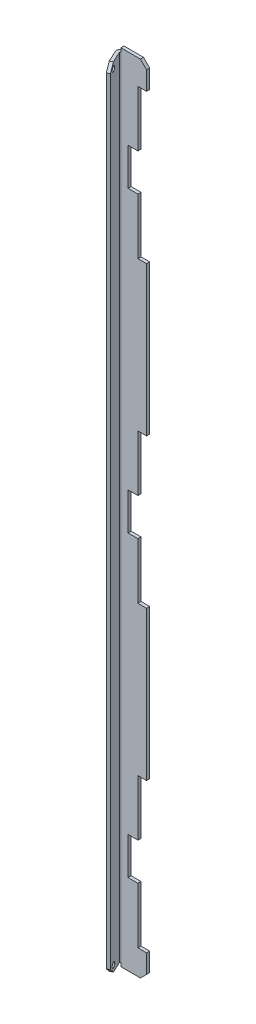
ISO-10303-21;
HEADER;
FILE_DESCRIPTION(('STEP AP214'),'2;1');
FILE_NAME('part.step','',(''),(''),'','','');
FILE_SCHEMA(('AUTOMOTIVE_DESIGN { 1 0 10303 214 1 1 1 1 }'));
ENDSEC;
DATA;
#1=APPLICATION_CONTEXT('core data for automotive mechanical design processes');
#2=APPLICATION_PROTOCOL_DEFINITION('international standard','automotive_design',2000,#1);
#3=PRODUCT_CONTEXT('',#1,'mechanical');
#4=PRODUCT('Part','Part','',(#3));
#5=PRODUCT_RELATED_PRODUCT_CATEGORY('part','',(#4));
#6=PRODUCT_DEFINITION_FORMATION('','',#4);
#7=PRODUCT_DEFINITION_CONTEXT('part definition',#1,'design');
#8=PRODUCT_DEFINITION('design','',#6,#7);
#9=PRODUCT_DEFINITION_SHAPE('','',#8);
#10=(LENGTH_UNIT() NAMED_UNIT(*) SI_UNIT(.MILLI.,.METRE.));
#11=(NAMED_UNIT(*) PLANE_ANGLE_UNIT() SI_UNIT($,.RADIAN.));
#12=(NAMED_UNIT(*) SI_UNIT($,.STERADIAN.) SOLID_ANGLE_UNIT());
#13=UNCERTAINTY_MEASURE_WITH_UNIT(LENGTH_MEASURE(1.E-05),#10,'distance_accuracy_value','');
#14=(GEOMETRIC_REPRESENTATION_CONTEXT(3) GLOBAL_UNCERTAINTY_ASSIGNED_CONTEXT((#13)) GLOBAL_UNIT_ASSIGNED_CONTEXT((#10,
#11,#12)) REPRESENTATION_CONTEXT('',''));
#15=CARTESIAN_POINT('',(0.,0.,0.));
#16=DIRECTION('',(0.,0.,1.));
#17=DIRECTION('',(1.,0.,0.));
#18=AXIS2_PLACEMENT_3D('',#15,#16,#17);
#19=CARTESIAN_POINT('',(-11.6273246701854,-320.,1.05654565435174));
#20=DIRECTION('',(0.906307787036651,0.,-0.422618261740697));
#21=DIRECTION('',(-0.422618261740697,0.,-0.906307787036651));
#22=AXIS2_PLACEMENT_3D('',#19,#20,#21);
#23=PLANE('',#22);
#24=DIRECTION('',(0.,1.,0.));
#25=VECTOR('',#24,1.);
#26=CARTESIAN_POINT('',(-4.95596320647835,-320.,15.3633264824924));
#27=LINE('',#26,#25);
#28=CARTESIAN_POINT('',(-4.95596320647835,-312.,15.3633264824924));
#29=VERTEX_POINT('',#28);
#30=CARTESIAN_POINT('',(-4.95596320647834,312.,15.3633264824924));
#31=VERTEX_POINT('',#30);
#32=EDGE_CURVE('E608',#29,#31,#27,.T.);
#33=ORIENTED_EDGE('',*,*,#32,.T.);
#34=DIRECTION('',(-0.298836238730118,0.707106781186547,-0.64085638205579));
#35=VECTOR('',#34,1.);
#36=CARTESIAN_POINT('',(-7.06905451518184,317.,10.8317875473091));
#37=LINE('',#36,#35);
#38=CARTESIAN_POINT('',(-7.06905451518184,317.,10.8317875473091));
#39=VERTEX_POINT('',#38);
#40=EDGE_CURVE('E13',#31,#39,#37,.T.);
#41=ORIENTED_EDGE('',*,*,#40,.T.);
#42=DIRECTION('',(0.422618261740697,0.,0.906307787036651));
#43=VECTOR('',#42,1.);
#44=CARTESIAN_POINT('',(-11.295635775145,317.,1.7678547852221));
#45=LINE('',#44,#43);
#46=CARTESIAN_POINT('',(-11.295635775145,317.,1.7678547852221));
#47=VERTEX_POINT('',#46);
#48=EDGE_CURVE('E424',#47,#39,#45,.T.);
#49=ORIENTED_EDGE('',*,*,#48,.F.);
#50=DIRECTION('',(0.,-1.,0.));
#51=VECTOR('',#50,1.);
#52=CARTESIAN_POINT('',(-11.295635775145,320.,1.76785478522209));
#53=LINE('',#52,#51);
#54=CARTESIAN_POINT('',(-11.295635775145,-317.,1.7678547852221));
#55=VERTEX_POINT('',#54);
#56=EDGE_CURVE('E611',#55,#47,#53,.F.);
#57=ORIENTED_EDGE('',*,*,#56,.F.);
#58=DIRECTION('',(0.422618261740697,0.,0.906307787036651));
#59=VECTOR('',#58,1.);
#60=CARTESIAN_POINT('',(-11.295635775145,-317.,1.7678547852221));
#61=LINE('',#60,#59);
#62=CARTESIAN_POINT('',(-7.06905451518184,-317.,10.8317875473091));
#63=VERTEX_POINT('',#62);
#64=EDGE_CURVE('E329',#55,#63,#61,.T.);
#65=ORIENTED_EDGE('',*,*,#64,.T.);
#66=DIRECTION('',(0.298836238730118,0.707106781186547,0.64085638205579));
#67=VECTOR('',#66,1.);
#68=CARTESIAN_POINT('',(-4.95596320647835,-312.,15.3633264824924));
#69=LINE('',#68,#67);
#70=EDGE_CURVE('E401',#63,#29,#69,.T.);
#71=ORIENTED_EDGE('',*,*,#70,.T.);
#72=EDGE_LOOP('',(#33,#41,#49,#57,#65,#71));
#73=FACE_BOUND('',#72,.T.);
#74=CARTESIAN_POINT('',(-7.06905451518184,312.,10.8317875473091));
#75=DIRECTION('',(-0.906307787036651,0.,0.422618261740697));
#76=DIRECTION('',(0.422618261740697,0.,0.906307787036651));
#77=AXIS2_PLACEMENT_3D('',#74,#75,#76);
#78=CIRCLE('',#77,2.);
#79=CARTESIAN_POINT('',(-6.22381799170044,312.,12.6444031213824));
#80=VERTEX_POINT('',#79);
#81=EDGE_CURVE('E408',#80,#80,#78,.T.);
#82=ORIENTED_EDGE('',*,*,#81,.F.);
#83=EDGE_LOOP('',(#82));
#84=FACE_BOUND('',#83,.T.);
#85=CARTESIAN_POINT('',(-7.06905451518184,-312.,10.8317875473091));
#86=DIRECTION('',(0.906307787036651,0.,-0.422618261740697));
#87=DIRECTION('',(0.422618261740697,0.,0.906307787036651));
#88=AXIS2_PLACEMENT_3D('',#85,#86,#87);
#89=CIRCLE('',#88,2.);
#90=CARTESIAN_POINT('',(-6.22381799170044,-312.,12.6444031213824));
#91=VERTEX_POINT('',#90);
#92=EDGE_CURVE('E416',#91,#91,#89,.T.);
#93=ORIENTED_EDGE('',*,*,#92,.T.);
#94=EDGE_LOOP('',(#93));
#95=FACE_BOUND('',#94,.T.);
#96=ADVANCED_FACE('F64',(#73,#84,#95),#23,.F.);
#97=CARTESIAN_POINT('',(-9.36155520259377,-320.,0.));
#98=DIRECTION('',(0.906307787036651,0.,-0.422618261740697));
#99=DIRECTION('',(-0.422618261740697,0.,-0.906307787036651));
#100=AXIS2_PLACEMENT_3D('',#97,#98,#99);
#101=PLANE('',#100);
#102=DIRECTION('',(-0.422618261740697,0.,-0.906307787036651));
#103=VECTOR('',#102,1.);
#104=CARTESIAN_POINT('',(-2.69019373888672,317.,14.3067808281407));
#105=LINE('',#104,#103);
#106=CARTESIAN_POINT('',(-4.80328504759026,317.,9.77524189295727));
#107=VERTEX_POINT('',#106);
#108=CARTESIAN_POINT('',(-9.02986630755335,317.,0.711309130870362));
#109=VERTEX_POINT('',#108);
#110=EDGE_CURVE('E427',#107,#109,#105,.T.);
#111=ORIENTED_EDGE('',*,*,#110,.F.);
#112=DIRECTION('',(0.298836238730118,-0.707106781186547,0.64085638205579));
#113=VECTOR('',#112,1.);
#114=CARTESIAN_POINT('',(127.52149623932,3.89289302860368,293.546651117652));
#115=LINE('',#114,#113);
#116=CARTESIAN_POINT('',(-2.69019373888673,312.,14.3067808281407));
#117=VERTEX_POINT('',#116);
#118=EDGE_CURVE('E88',#107,#117,#115,.T.);
#119=ORIENTED_EDGE('',*,*,#118,.T.);
#120=DIRECTION('',(0.,-1.,0.));
#121=VECTOR('',#120,1.);
#122=CARTESIAN_POINT('',(-2.69019373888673,320.,14.3067808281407));
#123=LINE('',#122,#121);
#124=CARTESIAN_POINT('',(-2.69019373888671,-312.,14.3067808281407));
#125=VERTEX_POINT('',#124);
#126=EDGE_CURVE('E610',#125,#117,#123,.F.);
#127=ORIENTED_EDGE('',*,*,#126,.F.);
#128=DIRECTION('',(-0.298836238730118,-0.707106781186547,-0.64085638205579));
#129=VECTOR('',#128,1.);
#130=CARTESIAN_POINT('',(-7.71634751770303,-323.892893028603,3.52815926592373));
#131=LINE('',#130,#129);
#132=CARTESIAN_POINT('',(-4.80328504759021,-317.,9.77524189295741));
#133=VERTEX_POINT('',#132);
#134=EDGE_CURVE('E397',#125,#133,#131,.T.);
#135=ORIENTED_EDGE('',*,*,#134,.T.);
#136=DIRECTION('',(-0.422618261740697,0.,-0.906307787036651));
#137=VECTOR('',#136,1.);
#138=CARTESIAN_POINT('',(-2.69019373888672,-317.,14.3067808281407));
#139=LINE('',#138,#137);
#140=CARTESIAN_POINT('',(-9.02986630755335,-317.,0.711309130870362));
#141=VERTEX_POINT('',#140);
#142=EDGE_CURVE('E420',#133,#141,#139,.T.);
#143=ORIENTED_EDGE('',*,*,#142,.T.);
#144=DIRECTION('',(0.,-1.,0.));
#145=VECTOR('',#144,1.);
#146=CARTESIAN_POINT('',(-9.02986630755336,320.,0.711309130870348));
#147=LINE('',#146,#145);
#148=EDGE_CURVE('E353',#109,#141,#147,.T.);
#149=ORIENTED_EDGE('',*,*,#148,.F.);
#150=EDGE_LOOP('',(#111,#119,#127,#135,#143,#149));
#151=FACE_BOUND('',#150,.T.);
#152=CARTESIAN_POINT('',(-4.80328504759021,312.,9.7752418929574));
#153=DIRECTION('',(0.906307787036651,0.,-0.422618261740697));
#154=DIRECTION('',(-0.422618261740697,0.,-0.906307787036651));
#155=AXIS2_PLACEMENT_3D('',#152,#153,#154);
#156=CIRCLE('',#155,2.);
#157=CARTESIAN_POINT('',(-5.6485215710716,312.,7.9626263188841));
#158=VERTEX_POINT('',#157);
#159=EDGE_CURVE('E332',#158,#158,#156,.T.);
#160=ORIENTED_EDGE('',*,*,#159,.F.);
#161=EDGE_LOOP('',(#160));
#162=FACE_BOUND('',#161,.T.);
#163=CARTESIAN_POINT('',(-4.80328504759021,-312.,9.7752418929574));
#164=DIRECTION('',(0.906307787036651,0.,-0.422618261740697));
#165=DIRECTION('',(-0.422618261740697,0.,-0.906307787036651));
#166=AXIS2_PLACEMENT_3D('',#163,#164,#165);
#167=CIRCLE('',#166,2.);
#168=CARTESIAN_POINT('',(-5.6485215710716,-312.,7.9626263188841));
#169=VERTEX_POINT('',#168);
#170=EDGE_CURVE('E68',#169,#169,#167,.F.);
#171=ORIENTED_EDGE('',*,*,#170,.T.);
#172=EDGE_LOOP('',(#171));
#173=FACE_BOUND('',#172,.T.);
#174=ADVANCED_FACE('F618',(#151,#162,#173),#101,.T.);
#175=CARTESIAN_POINT('',(-8.57671241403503,-320.,0.500000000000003));
#176=DIRECTION('',(0.,-1.,0.));
#177=DIRECTION('',(-0.906307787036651,0.,0.422618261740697));
#178=AXIS2_PLACEMENT_3D('',#175,#176,#177);
#179=CYLINDRICAL_SURFACE('',#178,3.);
#180=DIRECTION('',(0.,-1.,0.));
#181=VECTOR('',#180,1.);
#182=CARTESIAN_POINT('',(-8.57671241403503,-320.,-2.5));
#183=LINE('',#182,#181);
#184=CARTESIAN_POINT('',(-8.57671241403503,-317.,-2.49999999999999));
#185=VERTEX_POINT('',#184);
#186=CARTESIAN_POINT('',(-8.57671241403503,317.,-2.49999999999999));
#187=VERTEX_POINT('',#186);
#188=EDGE_CURVE('E335',#185,#187,#183,.F.);
#189=ORIENTED_EDGE('',*,*,#188,.F.);
#190=CARTESIAN_POINT('',(-8.57671241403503,-317.,0.500000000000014));
#191=DIRECTION('',(0.,1.,0.));
#192=DIRECTION('',(0.,0.,1.));
#193=AXIS2_PLACEMENT_3D('',#190,#191,#192);
#194=CIRCLE('',#193,3.);
#195=EDGE_CURVE('E322',#185,#55,#194,.T.);
#196=ORIENTED_EDGE('',*,*,#195,.T.);
#197=ORIENTED_EDGE('',*,*,#56,.T.);
#198=CARTESIAN_POINT('',(-8.57671241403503,317.,0.500000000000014));
#199=DIRECTION('',(0.,1.,0.));
#200=DIRECTION('',(0.,0.,1.));
#201=AXIS2_PLACEMENT_3D('',#198,#199,#200);
#202=CIRCLE('',#201,3.);
#203=EDGE_CURVE('E338',#187,#47,#202,.T.);
#204=ORIENTED_EDGE('',*,*,#203,.F.);
#205=EDGE_LOOP('',(#189,#196,#197,#204));
#206=FACE_BOUND('',#205,.T.);
#207=ADVANCED_FACE('F336',(#206),#179,.T.);
#208=CARTESIAN_POINT('',(-8.57671241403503,-320.,0.500000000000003));
#209=DIRECTION('',(0.,-1.,0.));
#210=DIRECTION('',(-0.906307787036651,0.,0.422618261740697));
#211=AXIS2_PLACEMENT_3D('',#208,#209,#210);
#212=CYLINDRICAL_SURFACE('',#211,0.499999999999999);
#213=CARTESIAN_POINT('',(-8.57671241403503,-317.,0.500000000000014));
#214=DIRECTION('',(0.,-1.,0.));
#215=DIRECTION('',(0.,0.,1.));
#216=AXIS2_PLACEMENT_3D('',#213,#214,#215);
#217=CIRCLE('',#216,0.499999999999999);
#218=CARTESIAN_POINT('',(-8.57671241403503,-317.,0.));
#219=VERTEX_POINT('',#218);
#220=EDGE_CURVE('E321',#141,#219,#217,.T.);
#221=ORIENTED_EDGE('',*,*,#220,.T.);
#222=DIRECTION('',(0.,-1.,0.));
#223=VECTOR('',#222,1.);
#224=CARTESIAN_POINT('',(-8.57671241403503,-320.,0.));
#225=LINE('',#224,#223);
#226=CARTESIAN_POINT('',(-8.57671241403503,317.,0.));
#227=VERTEX_POINT('',#226);
#228=EDGE_CURVE('E356',#219,#227,#225,.F.);
#229=ORIENTED_EDGE('',*,*,#228,.T.);
#230=CARTESIAN_POINT('',(-8.57671241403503,317.,0.500000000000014));
#231=DIRECTION('',(0.,-1.,0.));
#232=DIRECTION('',(0.,0.,1.));
#233=AXIS2_PLACEMENT_3D('',#230,#231,#232);
#234=CIRCLE('',#233,0.499999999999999);
#235=EDGE_CURVE('E429',#109,#227,#234,.T.);
#236=ORIENTED_EDGE('',*,*,#235,.F.);
#237=ORIENTED_EDGE('',*,*,#148,.T.);
#238=EDGE_LOOP('',(#221,#229,#236,#237));
#239=FACE_BOUND('',#238,.T.);
#240=ADVANCED_FACE('F616',(#239),#212,.F.);
#241=CARTESIAN_POINT('',(-4.95596320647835,320.,15.3633264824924));
#242=DIRECTION('',(-0.422618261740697,0.,-0.906307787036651));
#243=DIRECTION('',(-0.906307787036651,0.,0.422618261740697));
#244=AXIS2_PLACEMENT_3D('',#241,#242,#243);
#245=PLANE('',#244);
#246=ORIENTED_EDGE('',*,*,#126,.T.);
#247=DIRECTION('',(-0.906307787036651,0.,0.422618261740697));
#248=VECTOR('',#247,1.);
#249=CARTESIAN_POINT('',(-4.95596320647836,312.,15.3633264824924));
#250=LINE('',#249,#248);
#251=EDGE_CURVE('E73',#117,#31,#250,.T.);
#252=ORIENTED_EDGE('',*,*,#251,.T.);
#253=ORIENTED_EDGE('',*,*,#32,.F.);
#254=DIRECTION('',(0.906307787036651,0.,-0.422618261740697));
#255=VECTOR('',#254,1.);
#256=CARTESIAN_POINT('',(-2.69019373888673,-312.,14.3067808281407));
#257=LINE('',#256,#255);
#258=EDGE_CURVE('E394',#29,#125,#257,.T.);
#259=ORIENTED_EDGE('',*,*,#258,.T.);
#260=EDGE_LOOP('',(#246,#252,#253,#259));
#261=FACE_BOUND('',#260,.T.);
#262=ADVANCED_FACE('F628',(#261),#245,.F.);
#263=CARTESIAN_POINT('',(12.12,-320.,-2.5));
#264=DIRECTION('',(1.,0.,0.));
#265=DIRECTION('',(0.,0.,-1.));
#266=AXIS2_PLACEMENT_3D('',#263,#264,#265);
#267=PLANE('',#266);
#268=DIRECTION('',(0.,1.,0.));
#269=VECTOR('',#268,1.);
#270=CARTESIAN_POINT('',(12.12,-320.,0.));
#271=LINE('',#270,#269);
#272=CARTESIAN_POINT('',(12.12,-315.,0.));
#273=VERTEX_POINT('',#272);
#274=CARTESIAN_POINT('',(12.12,-300.,0.));
#275=VERTEX_POINT('',#274);
#276=EDGE_CURVE('E368',#273,#275,#271,.T.);
#277=ORIENTED_EDGE('',*,*,#276,.F.);
#278=DIRECTION('',(0.,0.,-1.));
#279=VECTOR('',#278,1.);
#280=CARTESIAN_POINT('',(12.12,-315.,-2.5));
#281=LINE('',#280,#279);
#282=CARTESIAN_POINT('',(12.12,-315.,-2.5));
#283=VERTEX_POINT('',#282);
#284=EDGE_CURVE('E390',#273,#283,#281,.T.);
#285=ORIENTED_EDGE('',*,*,#284,.T.);
#286=DIRECTION('',(0.,1.,0.));
#287=VECTOR('',#286,1.);
#288=CARTESIAN_POINT('',(12.12,-320.,-2.5));
#289=LINE('',#288,#287);
#290=CARTESIAN_POINT('',(12.12,-300.,-2.5));
#291=VERTEX_POINT('',#290);
#292=EDGE_CURVE('E359',#283,#291,#289,.T.);
#293=ORIENTED_EDGE('',*,*,#292,.T.);
#294=DIRECTION('',(0.,0.,1.));
#295=VECTOR('',#294,1.);
#296=CARTESIAN_POINT('',(12.12,-300.,-2.501));
#297=LINE('',#296,#295);
#298=EDGE_CURVE('E443',#291,#275,#297,.T.);
#299=ORIENTED_EDGE('',*,*,#298,.T.);
#300=EDGE_LOOP('',(#277,#285,#293,#299));
#301=FACE_BOUND('',#300,.T.);
#302=ADVANCED_FACE('F756',(#301),#267,.T.);
#303=DIRECTION('',(0.,0.,1.));
#304=VECTOR('',#303,1.);
#305=CARTESIAN_POINT('',(12.12,-60.,-2.501));
#306=LINE('',#305,#304);
#307=CARTESIAN_POINT('',(12.12,-60.,-2.5));
#308=VERTEX_POINT('',#307);
#309=CARTESIAN_POINT('',(12.12,-60.,0.));
#310=VERTEX_POINT('',#309);
#311=EDGE_CURVE('E462',#308,#310,#306,.T.);
#312=ORIENTED_EDGE('',*,*,#311,.T.);
#313=CARTESIAN_POINT('',(12.12,-180.,0.));
#314=VERTEX_POINT('',#313);
#315=EDGE_CURVE('E371',#314,#310,#271,.T.);
#316=ORIENTED_EDGE('',*,*,#315,.F.);
#317=DIRECTION('',(0.,0.,1.));
#318=VECTOR('',#317,1.);
#319=CARTESIAN_POINT('',(12.12,-180.,-2.501));
#320=LINE('',#319,#318);
#321=CARTESIAN_POINT('',(12.12,-180.,-2.5));
#322=VERTEX_POINT('',#321);
#323=EDGE_CURVE('E504',#322,#314,#320,.T.);
#324=ORIENTED_EDGE('',*,*,#323,.F.);
#325=EDGE_CURVE('E362',#322,#308,#289,.T.);
#326=ORIENTED_EDGE('',*,*,#325,.T.);
#327=EDGE_LOOP('',(#312,#316,#324,#326));
#328=FACE_BOUND('',#327,.T.);
#329=ADVANCED_FACE('F672',(#328),#267,.T.);
#330=DIRECTION('',(0.,0.,1.));
#331=VECTOR('',#330,1.);
#332=CARTESIAN_POINT('',(12.12,180.,-2.501));
#333=LINE('',#332,#331);
#334=CARTESIAN_POINT('',(12.12,180.,-2.5));
#335=VERTEX_POINT('',#334);
#336=CARTESIAN_POINT('',(12.12,180.,0.));
#337=VERTEX_POINT('',#336);
#338=EDGE_CURVE('E480',#335,#337,#333,.T.);
#339=ORIENTED_EDGE('',*,*,#338,.T.);
#340=CARTESIAN_POINT('',(12.12,60.,0.));
#341=VERTEX_POINT('',#340);
#342=EDGE_CURVE('E659',#341,#337,#271,.T.);
#343=ORIENTED_EDGE('',*,*,#342,.F.);
#344=DIRECTION('',(0.,0.,1.));
#345=VECTOR('',#344,1.);
#346=CARTESIAN_POINT('',(12.12,60.,-2.501));
#347=LINE('',#346,#345);
#348=CARTESIAN_POINT('',(12.12,60.,-2.5));
#349=VERTEX_POINT('',#348);
#350=EDGE_CURVE('E521',#349,#341,#347,.T.);
#351=ORIENTED_EDGE('',*,*,#350,.F.);
#352=EDGE_CURVE('E701',#349,#335,#289,.T.);
#353=ORIENTED_EDGE('',*,*,#352,.T.);
#354=EDGE_LOOP('',(#339,#343,#351,#353));
#355=FACE_BOUND('',#354,.T.);
#356=ADVANCED_FACE('F706',(#355),#267,.T.);
#357=CARTESIAN_POINT('',(-12.12,-320.,-2.5));
#358=DIRECTION('',(0.,-1.,0.));
#359=DIRECTION('',(0.,0.,-1.));
#360=AXIS2_PLACEMENT_3D('',#357,#358,#359);
#361=PLANE('',#360);
#362=DIRECTION('',(1.,0.,0.));
#363=VECTOR('',#362,1.);
#364=CARTESIAN_POINT('',(-12.12,-320.,-2.5));
#365=LINE('',#364,#363);
#366=CARTESIAN_POINT('',(-8.57671241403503,-320.,-2.5));
#367=VERTEX_POINT('',#366);
#368=CARTESIAN_POINT('',(7.12000000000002,-320.,-2.5));
#369=VERTEX_POINT('',#368);
#370=EDGE_CURVE('E347',#367,#369,#365,.T.);
#371=ORIENTED_EDGE('',*,*,#370,.T.);
#372=DIRECTION('',(0.,0.,1.));
#373=VECTOR('',#372,1.);
#374=CARTESIAN_POINT('',(7.12,-320.,-2.5));
#375=LINE('',#374,#373);
#376=CARTESIAN_POINT('',(7.12,-320.,0.));
#377=VERTEX_POINT('',#376);
#378=EDGE_CURVE('E385',#369,#377,#375,.T.);
#379=ORIENTED_EDGE('',*,*,#378,.T.);
#380=DIRECTION('',(1.,0.,0.));
#381=VECTOR('',#380,1.);
#382=CARTESIAN_POINT('',(-12.12,-320.,0.));
#383=LINE('',#382,#381);
#384=CARTESIAN_POINT('',(-8.57671241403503,-320.,0.));
#385=VERTEX_POINT('',#384);
#386=EDGE_CURVE('E374',#385,#377,#383,.T.);
#387=ORIENTED_EDGE('',*,*,#386,.F.);
#388=DIRECTION('',(0.,0.,-1.));
#389=VECTOR('',#388,1.);
#390=CARTESIAN_POINT('',(-8.57671241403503,-320.,0.));
#391=LINE('',#390,#389);
#392=EDGE_CURVE('E348',#385,#367,#391,.T.);
#393=ORIENTED_EDGE('',*,*,#392,.T.);
#394=EDGE_LOOP('',(#371,#379,#387,#393));
#395=FACE_BOUND('',#394,.T.);
#396=ADVANCED_FACE('F763',(#395),#361,.T.);
#397=CARTESIAN_POINT('',(12.12,320.,-2.5));
#398=DIRECTION('',(0.,0.,-1.));
#399=DIRECTION('',(-1.,0.,0.));
#400=AXIS2_PLACEMENT_3D('',#397,#398,#399);
#401=PLANE('',#400);
#402=ORIENTED_EDGE('',*,*,#292,.F.);
#403=DIRECTION('',(0.707106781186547,0.707106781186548,0.));
#404=VECTOR('',#403,1.);
#405=CARTESIAN_POINT('',(329.62,2.50000000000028,-2.5));
#406=LINE('',#405,#404);
#407=EDGE_CURVE('E392',#283,#369,#406,.F.);
#408=ORIENTED_EDGE('',*,*,#407,.T.);
#409=ORIENTED_EDGE('',*,*,#370,.F.);
#410=EDGE_CURVE('E314',#367,#185,#183,.F.);
#411=ORIENTED_EDGE('',*,*,#410,.T.);
#412=ORIENTED_EDGE('',*,*,#188,.T.);
#413=DIRECTION('',(0.,1.,0.));
#414=VECTOR('',#413,1.);
#415=CARTESIAN_POINT('',(-8.57671241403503,317.,-2.49999999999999));
#416=LINE('',#415,#414);
#417=CARTESIAN_POINT('',(-8.57671241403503,320.,-2.5));
#418=VERTEX_POINT('',#417);
#419=EDGE_CURVE('E436',#187,#418,#416,.T.);
#420=ORIENTED_EDGE('',*,*,#419,.T.);
#421=DIRECTION('',(-1.,0.,0.));
#422=VECTOR('',#421,1.);
#423=CARTESIAN_POINT('',(-12.12,320.,-2.5));
#424=LINE('',#423,#422);
#425=CARTESIAN_POINT('',(7.12,320.,-2.5));
#426=VERTEX_POINT('',#425);
#427=EDGE_CURVE('E361',#426,#418,#424,.T.);
#428=ORIENTED_EDGE('',*,*,#427,.F.);
#429=DIRECTION('',(-0.707106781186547,0.707106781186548,0.));
#430=VECTOR('',#429,1.);
#431=CARTESIAN_POINT('',(9.62,317.5,-2.5));
#432=LINE('',#431,#430);
#433=CARTESIAN_POINT('',(12.12,315.,-2.5));
#434=VERTEX_POINT('',#433);
#435=EDGE_CURVE('E383',#426,#434,#432,.F.);
#436=ORIENTED_EDGE('',*,*,#435,.T.);
#437=CARTESIAN_POINT('',(12.12,300.,-2.5));
#438=VERTEX_POINT('',#437);
#439=EDGE_CURVE('E363',#438,#434,#289,.T.);
#440=ORIENTED_EDGE('',*,*,#439,.F.);
#441=DIRECTION('',(-1.,0.,0.));
#442=VECTOR('',#441,1.);
#443=CARTESIAN_POINT('',(12.12,300.,-2.5));
#444=LINE('',#443,#442);
#445=CARTESIAN_POINT('',(5.12,300.,-2.5));
#446=VERTEX_POINT('',#445);
#447=EDGE_CURVE('E541',#438,#446,#444,.T.);
#448=ORIENTED_EDGE('',*,*,#447,.T.);
#449=DIRECTION('',(0.,-1.,0.));
#450=VECTOR('',#449,1.);
#451=CARTESIAN_POINT('',(5.12,300.,-2.5));
#452=LINE('',#451,#450);
#453=CARTESIAN_POINT('',(5.12,255.,-2.5));
#454=VERTEX_POINT('',#453);
#455=EDGE_CURVE('E530',#446,#454,#452,.T.);
#456=ORIENTED_EDGE('',*,*,#455,.T.);
#457=DIRECTION('',(-1.,0.,0.));
#458=VECTOR('',#457,1.);
#459=CARTESIAN_POINT('',(12.12,255.,-2.5));
#460=LINE('',#459,#458);
#461=CARTESIAN_POINT('',(-2.88,255.,-2.5));
#462=VERTEX_POINT('',#461);
#463=EDGE_CURVE('E604',#454,#462,#460,.T.);
#464=ORIENTED_EDGE('',*,*,#463,.T.);
#465=DIRECTION('',(0.,-1.,0.));
#466=VECTOR('',#465,1.);
#467=CARTESIAN_POINT('',(-2.88,255.,-2.5));
#468=LINE('',#467,#466);
#469=CARTESIAN_POINT('',(-2.88,225.,-2.5));
#470=VERTEX_POINT('',#469);
#471=EDGE_CURVE('E587',#462,#470,#468,.T.);
#472=ORIENTED_EDGE('',*,*,#471,.T.);
#473=DIRECTION('',(1.,0.,0.));
#474=VECTOR('',#473,1.);
#475=CARTESIAN_POINT('',(12.12,225.,-2.5));
#476=LINE('',#475,#474);
#477=CARTESIAN_POINT('',(5.12000000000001,225.,-2.5));
#478=VERTEX_POINT('',#477);
#479=EDGE_CURVE('E590',#470,#478,#476,.T.);
#480=ORIENTED_EDGE('',*,*,#479,.T.);
#481=DIRECTION('',(0.,-1.,0.));
#482=VECTOR('',#481,1.);
#483=CARTESIAN_POINT('',(5.12,300.,-2.5));
#484=LINE('',#483,#482);
#485=CARTESIAN_POINT('',(5.12000000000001,180.,-2.5));
#486=VERTEX_POINT('',#485);
#487=EDGE_CURVE('E472',#478,#486,#484,.T.);
#488=ORIENTED_EDGE('',*,*,#487,.T.);
#489=DIRECTION('',(1.,0.,0.));
#490=VECTOR('',#489,1.);
#491=CARTESIAN_POINT('',(12.12,180.,-2.5));
#492=LINE('',#491,#490);
#493=EDGE_CURVE('E484',#486,#335,#492,.T.);
#494=ORIENTED_EDGE('',*,*,#493,.T.);
#495=ORIENTED_EDGE('',*,*,#352,.F.);
#496=DIRECTION('',(-1.,0.,0.));
#497=VECTOR('',#496,1.);
#498=CARTESIAN_POINT('',(12.12,60.,-2.5));
#499=LINE('',#498,#497);
#500=CARTESIAN_POINT('',(5.12000000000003,60.,-2.5));
#501=VERTEX_POINT('',#500);
#502=EDGE_CURVE('E524',#349,#501,#499,.T.);
#503=ORIENTED_EDGE('',*,*,#502,.T.);
#504=DIRECTION('',(0.,-1.,0.));
#505=VECTOR('',#504,1.);
#506=CARTESIAN_POINT('',(5.12000000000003,60.,-2.5));
#507=LINE('',#506,#505);
#508=CARTESIAN_POINT('',(5.12000000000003,15.,-2.5));
#509=VERTEX_POINT('',#508);
#510=EDGE_CURVE('E513',#501,#509,#507,.T.);
#511=ORIENTED_EDGE('',*,*,#510,.T.);
#512=DIRECTION('',(-1.,0.,0.));
#513=VECTOR('',#512,1.);
#514=CARTESIAN_POINT('',(12.12,15.,-2.5));
#515=LINE('',#514,#513);
#516=CARTESIAN_POINT('',(-2.87999999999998,15.,-2.5));
#517=VERTEX_POINT('',#516);
#518=EDGE_CURVE('E583',#509,#517,#515,.T.);
#519=ORIENTED_EDGE('',*,*,#518,.T.);
#520=DIRECTION('',(0.,-1.,0.));
#521=VECTOR('',#520,1.);
#522=CARTESIAN_POINT('',(-2.87999999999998,15.,-2.5));
#523=LINE('',#522,#521);
#524=CARTESIAN_POINT('',(-2.87999999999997,-15.,-2.5));
#525=VERTEX_POINT('',#524);
#526=EDGE_CURVE('E566',#517,#525,#523,.T.);
#527=ORIENTED_EDGE('',*,*,#526,.T.);
#528=DIRECTION('',(1.,0.,0.));
#529=VECTOR('',#528,1.);
#530=CARTESIAN_POINT('',(12.12,-15.,-2.5));
#531=LINE('',#530,#529);
#532=CARTESIAN_POINT('',(5.12000000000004,-15.,-2.5));
#533=VERTEX_POINT('',#532);
#534=EDGE_CURVE('E569',#525,#533,#531,.T.);
#535=ORIENTED_EDGE('',*,*,#534,.T.);
#536=DIRECTION('',(0.,-1.,0.));
#537=VECTOR('',#536,1.);
#538=CARTESIAN_POINT('',(5.12000000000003,60.,-2.5));
#539=LINE('',#538,#537);
#540=CARTESIAN_POINT('',(5.12000000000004,-60.,-2.5));
#541=VERTEX_POINT('',#540);
#542=EDGE_CURVE('E454',#533,#541,#539,.T.);
#543=ORIENTED_EDGE('',*,*,#542,.T.);
#544=DIRECTION('',(1.,0.,0.));
#545=VECTOR('',#544,1.);
#546=CARTESIAN_POINT('',(12.12,-60.,-2.5));
#547=LINE('',#546,#545);
#548=EDGE_CURVE('E466',#541,#308,#547,.T.);
#549=ORIENTED_EDGE('',*,*,#548,.T.);
#550=ORIENTED_EDGE('',*,*,#325,.F.);
#551=DIRECTION('',(-1.,0.,0.));
#552=VECTOR('',#551,1.);
#553=CARTESIAN_POINT('',(12.12,-180.,-2.5));
#554=LINE('',#553,#552);
#555=CARTESIAN_POINT('',(5.12000000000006,-180.,-2.5));
#556=VERTEX_POINT('',#555);
#557=EDGE_CURVE('E507',#322,#556,#554,.T.);
#558=ORIENTED_EDGE('',*,*,#557,.T.);
#559=DIRECTION('',(0.,-1.,0.));
#560=VECTOR('',#559,1.);
#561=CARTESIAN_POINT('',(5.12000000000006,-180.,-2.5));
#562=LINE('',#561,#560);
#563=CARTESIAN_POINT('',(5.12000000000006,-225.,-2.5));
#564=VERTEX_POINT('',#563);
#565=EDGE_CURVE('E496',#556,#564,#562,.T.);
#566=ORIENTED_EDGE('',*,*,#565,.T.);
#567=DIRECTION('',(-1.,0.,0.));
#568=VECTOR('',#567,1.);
#569=CARTESIAN_POINT('',(12.12,-225.,-2.5));
#570=LINE('',#569,#568);
#571=CARTESIAN_POINT('',(-2.87999999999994,-225.,-2.5));
#572=VERTEX_POINT('',#571);
#573=EDGE_CURVE('E562',#564,#572,#570,.T.);
#574=ORIENTED_EDGE('',*,*,#573,.T.);
#575=DIRECTION('',(0.,-1.,0.));
#576=VECTOR('',#575,1.);
#577=CARTESIAN_POINT('',(-2.87999999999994,-225.,-2.5));
#578=LINE('',#577,#576);
#579=CARTESIAN_POINT('',(-2.87999999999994,-255.,-2.5));
#580=VERTEX_POINT('',#579);
#581=EDGE_CURVE('E545',#572,#580,#578,.T.);
#582=ORIENTED_EDGE('',*,*,#581,.T.);
#583=DIRECTION('',(1.,0.,0.));
#584=VECTOR('',#583,1.);
#585=CARTESIAN_POINT('',(12.12,-255.,-2.5));
#586=LINE('',#585,#584);
#587=CARTESIAN_POINT('',(5.12000000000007,-255.,-2.5));
#588=VERTEX_POINT('',#587);
#589=EDGE_CURVE('E548',#580,#588,#586,.T.);
#590=ORIENTED_EDGE('',*,*,#589,.T.);
#591=DIRECTION('',(0.,-1.,0.));
#592=VECTOR('',#591,1.);
#593=CARTESIAN_POINT('',(5.12000000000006,-180.,-2.5));
#594=LINE('',#593,#592);
#595=CARTESIAN_POINT('',(5.12000000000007,-300.,-2.5));
#596=VERTEX_POINT('',#595);
#597=EDGE_CURVE('E438',#588,#596,#594,.T.);
#598=ORIENTED_EDGE('',*,*,#597,.T.);
#599=DIRECTION('',(1.,0.,0.));
#600=VECTOR('',#599,1.);
#601=CARTESIAN_POINT('',(12.12,-300.,-2.5));
#602=LINE('',#601,#600);
#603=EDGE_CURVE('E447',#596,#291,#602,.T.);
#604=ORIENTED_EDGE('',*,*,#603,.T.);
#605=EDGE_LOOP('',(#402,#408,#409,#411,#412,#420,#428,#436,#440,#448,#456,#464,#472,#480,#488,
#494,#495,#503,#511,#519,#527,#535,#543,#549,#550,#558,#566,#574,#582,#590,#598,#604));
#606=FACE_BOUND('',#605,.T.);
#607=ADVANCED_FACE('F345',(#606),#401,.T.);
#608=CARTESIAN_POINT('',(12.12,320.,0.));
#609=DIRECTION('',(0.,0.,-1.));
#610=DIRECTION('',(-1.,0.,0.));
#611=AXIS2_PLACEMENT_3D('',#608,#609,#610);
#612=PLANE('',#611);
#613=ORIENTED_EDGE('',*,*,#386,.T.);
#614=DIRECTION('',(-0.707106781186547,-0.707106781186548,0.));
#615=VECTOR('',#614,1.);
#616=CARTESIAN_POINT('',(7.12,-320.,0.));
#617=LINE('',#616,#615);
#618=EDGE_CURVE('E388',#377,#273,#617,.F.);
#619=ORIENTED_EDGE('',*,*,#618,.T.);
#620=ORIENTED_EDGE('',*,*,#276,.T.);
#621=DIRECTION('',(1.,0.,0.));
#622=VECTOR('',#621,1.);
#623=CARTESIAN_POINT('',(12.12,-300.,0.));
#624=LINE('',#623,#622);
#625=CARTESIAN_POINT('',(5.12000000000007,-300.,0.));
#626=VERTEX_POINT('',#625);
#627=EDGE_CURVE('E448',#626,#275,#624,.T.);
#628=ORIENTED_EDGE('',*,*,#627,.F.);
#629=DIRECTION('',(0.,-1.,0.));
#630=VECTOR('',#629,1.);
#631=CARTESIAN_POINT('',(5.12000000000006,-180.,0.));
#632=LINE('',#631,#630);
#633=CARTESIAN_POINT('',(5.12000000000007,-255.,0.));
#634=VERTEX_POINT('',#633);
#635=EDGE_CURVE('E442',#634,#626,#632,.T.);
#636=ORIENTED_EDGE('',*,*,#635,.F.);
#637=DIRECTION('',(1.,0.,0.));
#638=VECTOR('',#637,1.);
#639=CARTESIAN_POINT('',(12.12,-255.,0.));
#640=LINE('',#639,#638);
#641=CARTESIAN_POINT('',(-2.87999999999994,-255.,0.));
#642=VERTEX_POINT('',#641);
#643=EDGE_CURVE('E556',#642,#634,#640,.T.);
#644=ORIENTED_EDGE('',*,*,#643,.F.);
#645=DIRECTION('',(0.,-1.,0.));
#646=VECTOR('',#645,1.);
#647=CARTESIAN_POINT('',(-2.87999999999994,-225.,0.));
#648=LINE('',#647,#646);
#649=CARTESIAN_POINT('',(-2.87999999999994,-225.,0.));
#650=VERTEX_POINT('',#649);
#651=EDGE_CURVE('E553',#650,#642,#648,.T.);
#652=ORIENTED_EDGE('',*,*,#651,.F.);
#653=DIRECTION('',(-1.,0.,0.));
#654=VECTOR('',#653,1.);
#655=CARTESIAN_POINT('',(12.12,-225.,0.));
#656=LINE('',#655,#654);
#657=CARTESIAN_POINT('',(5.12000000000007,-225.,0.));
#658=VERTEX_POINT('',#657);
#659=EDGE_CURVE('E551',#658,#650,#656,.T.);
#660=ORIENTED_EDGE('',*,*,#659,.F.);
#661=DIRECTION('',(0.,-1.,0.));
#662=VECTOR('',#661,1.);
#663=CARTESIAN_POINT('',(5.12000000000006,-180.,0.));
#664=LINE('',#663,#662);
#665=CARTESIAN_POINT('',(5.12000000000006,-180.,0.));
#666=VERTEX_POINT('',#665);
#667=EDGE_CURVE('E502',#666,#658,#664,.T.);
#668=ORIENTED_EDGE('',*,*,#667,.F.);
#669=DIRECTION('',(-1.,0.,0.));
#670=VECTOR('',#669,1.);
#671=CARTESIAN_POINT('',(12.12,-180.,0.));
#672=LINE('',#671,#670);
#673=EDGE_CURVE('E499',#314,#666,#672,.T.);
#674=ORIENTED_EDGE('',*,*,#673,.F.);
#675=ORIENTED_EDGE('',*,*,#315,.T.);
#676=DIRECTION('',(1.,0.,0.));
#677=VECTOR('',#676,1.);
#678=CARTESIAN_POINT('',(12.12,-60.,0.));
#679=LINE('',#678,#677);
#680=CARTESIAN_POINT('',(5.12000000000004,-60.,0.));
#681=VERTEX_POINT('',#680);
#682=EDGE_CURVE('E467',#681,#310,#679,.T.);
#683=ORIENTED_EDGE('',*,*,#682,.F.);
#684=DIRECTION('',(0.,-1.,0.));
#685=VECTOR('',#684,1.);
#686=CARTESIAN_POINT('',(5.12000000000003,60.,0.));
#687=LINE('',#686,#685);
#688=CARTESIAN_POINT('',(5.12000000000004,-15.,0.));
#689=VERTEX_POINT('',#688);
#690=EDGE_CURVE('E461',#689,#681,#687,.T.);
#691=ORIENTED_EDGE('',*,*,#690,.F.);
#692=DIRECTION('',(1.,0.,0.));
#693=VECTOR('',#692,1.);
#694=CARTESIAN_POINT('',(12.12,-15.,0.));
#695=LINE('',#694,#693);
#696=CARTESIAN_POINT('',(-2.87999999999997,-15.,0.));
#697=VERTEX_POINT('',#696);
#698=EDGE_CURVE('E577',#697,#689,#695,.T.);
#699=ORIENTED_EDGE('',*,*,#698,.F.);
#700=DIRECTION('',(0.,-1.,0.));
#701=VECTOR('',#700,1.);
#702=CARTESIAN_POINT('',(-2.87999999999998,15.,0.));
#703=LINE('',#702,#701);
#704=CARTESIAN_POINT('',(-2.87999999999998,15.,0.));
#705=VERTEX_POINT('',#704);
#706=EDGE_CURVE('E574',#705,#697,#703,.T.);
#707=ORIENTED_EDGE('',*,*,#706,.F.);
#708=DIRECTION('',(-1.,0.,0.));
#709=VECTOR('',#708,1.);
#710=CARTESIAN_POINT('',(12.12,15.,0.));
#711=LINE('',#710,#709);
#712=CARTESIAN_POINT('',(5.12000000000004,15.,0.));
#713=VERTEX_POINT('',#712);
#714=EDGE_CURVE('E572',#713,#705,#711,.T.);
#715=ORIENTED_EDGE('',*,*,#714,.F.);
#716=DIRECTION('',(0.,-1.,0.));
#717=VECTOR('',#716,1.);
#718=CARTESIAN_POINT('',(5.12000000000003,60.,0.));
#719=LINE('',#718,#717);
#720=CARTESIAN_POINT('',(5.12000000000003,60.,0.));
#721=VERTEX_POINT('',#720);
#722=EDGE_CURVE('E519',#721,#713,#719,.T.);
#723=ORIENTED_EDGE('',*,*,#722,.F.);
#724=DIRECTION('',(-1.,0.,0.));
#725=VECTOR('',#724,1.);
#726=CARTESIAN_POINT('',(12.12,60.,0.));
#727=LINE('',#726,#725);
#728=EDGE_CURVE('E516',#341,#721,#727,.T.);
#729=ORIENTED_EDGE('',*,*,#728,.F.);
#730=ORIENTED_EDGE('',*,*,#342,.T.);
#731=DIRECTION('',(1.,0.,0.));
#732=VECTOR('',#731,1.);
#733=CARTESIAN_POINT('',(12.12,180.,0.));
#734=LINE('',#733,#732);
#735=CARTESIAN_POINT('',(5.12000000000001,180.,0.));
#736=VERTEX_POINT('',#735);
#737=EDGE_CURVE('E485',#736,#337,#734,.T.);
#738=ORIENTED_EDGE('',*,*,#737,.F.);
#739=DIRECTION('',(0.,-1.,0.));
#740=VECTOR('',#739,1.);
#741=CARTESIAN_POINT('',(5.12,300.,0.));
#742=LINE('',#741,#740);
#743=CARTESIAN_POINT('',(5.12000000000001,225.,0.));
#744=VERTEX_POINT('',#743);
#745=EDGE_CURVE('E479',#744,#736,#742,.T.);
#746=ORIENTED_EDGE('',*,*,#745,.F.);
#747=DIRECTION('',(1.,0.,0.));
#748=VECTOR('',#747,1.);
#749=CARTESIAN_POINT('',(12.12,225.,0.));
#750=LINE('',#749,#748);
#751=CARTESIAN_POINT('',(-2.88,225.,0.));
#752=VERTEX_POINT('',#751);
#753=EDGE_CURVE('E598',#752,#744,#750,.T.);
#754=ORIENTED_EDGE('',*,*,#753,.F.);
#755=DIRECTION('',(0.,-1.,0.));
#756=VECTOR('',#755,1.);
#757=CARTESIAN_POINT('',(-2.88,255.,0.));
#758=LINE('',#757,#756);
#759=CARTESIAN_POINT('',(-2.88,255.,0.));
#760=VERTEX_POINT('',#759);
#761=EDGE_CURVE('E595',#760,#752,#758,.T.);
#762=ORIENTED_EDGE('',*,*,#761,.F.);
#763=DIRECTION('',(-1.,0.,0.));
#764=VECTOR('',#763,1.);
#765=CARTESIAN_POINT('',(12.12,255.,0.));
#766=LINE('',#765,#764);
#767=CARTESIAN_POINT('',(5.12,255.,0.));
#768=VERTEX_POINT('',#767);
#769=EDGE_CURVE('E593',#768,#760,#766,.T.);
#770=ORIENTED_EDGE('',*,*,#769,.F.);
#771=DIRECTION('',(0.,-1.,0.));
#772=VECTOR('',#771,1.);
#773=CARTESIAN_POINT('',(5.12,300.,0.));
#774=LINE('',#773,#772);
#775=CARTESIAN_POINT('',(5.12,300.,0.));
#776=VERTEX_POINT('',#775);
#777=EDGE_CURVE('E536',#776,#768,#774,.T.);
#778=ORIENTED_EDGE('',*,*,#777,.F.);
#779=DIRECTION('',(-1.,0.,0.));
#780=VECTOR('',#779,1.);
#781=CARTESIAN_POINT('',(12.12,300.,0.));
#782=LINE('',#781,#780);
#783=CARTESIAN_POINT('',(12.12,300.,0.));
#784=VERTEX_POINT('',#783);
#785=EDGE_CURVE('E533',#784,#776,#782,.T.);
#786=ORIENTED_EDGE('',*,*,#785,.F.);
#787=CARTESIAN_POINT('',(12.12,315.,0.));
#788=VERTEX_POINT('',#787);
#789=EDGE_CURVE('E357',#784,#788,#271,.T.);
#790=ORIENTED_EDGE('',*,*,#789,.T.);
#791=DIRECTION('',(0.707106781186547,-0.707106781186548,0.));
#792=VECTOR('',#791,1.);
#793=CARTESIAN_POINT('',(12.12,315.,0.));
#794=LINE('',#793,#792);
#795=CARTESIAN_POINT('',(7.12,320.,0.));
#796=VERTEX_POINT('',#795);
#797=EDGE_CURVE('E379',#788,#796,#794,.F.);
#798=ORIENTED_EDGE('',*,*,#797,.T.);
#799=DIRECTION('',(-1.,0.,0.));
#800=VECTOR('',#799,1.);
#801=CARTESIAN_POINT('',(-12.12,320.,0.));
#802=LINE('',#801,#800);
#803=CARTESIAN_POINT('',(-8.57671241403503,320.,0.));
#804=VERTEX_POINT('',#803);
#805=EDGE_CURVE('E370',#796,#804,#802,.T.);
#806=ORIENTED_EDGE('',*,*,#805,.T.);
#807=DIRECTION('',(0.,1.,0.));
#808=VECTOR('',#807,1.);
#809=CARTESIAN_POINT('',(-8.57671241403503,317.,0.));
#810=LINE('',#809,#808);
#811=EDGE_CURVE('E435',#227,#804,#810,.T.);
#812=ORIENTED_EDGE('',*,*,#811,.F.);
#813=ORIENTED_EDGE('',*,*,#228,.F.);
#814=EDGE_CURVE('E317',#385,#219,#225,.F.);
#815=ORIENTED_EDGE('',*,*,#814,.F.);
#816=EDGE_LOOP('',(#613,#619,#620,#628,#636,#644,#652,#660,#668,#674,#675,#683,#691,#699,#707,
#715,#723,#729,#730,#738,#746,#754,#762,#770,#778,#786,#790,#798,#806,#812,#813,#815));
#817=FACE_BOUND('',#816,.T.);
#818=ADVANCED_FACE('F639',(#817),#612,.F.);
#819=ORIENTED_EDGE('',*,*,#439,.T.);
#820=DIRECTION('',(0.,0.,1.));
#821=VECTOR('',#820,1.);
#822=CARTESIAN_POINT('',(12.12,315.,-2.5));
#823=LINE('',#822,#821);
#824=EDGE_CURVE('E367',#434,#788,#823,.T.);
#825=ORIENTED_EDGE('',*,*,#824,.T.);
#826=ORIENTED_EDGE('',*,*,#789,.F.);
#827=DIRECTION('',(0.,0.,1.));
#828=VECTOR('',#827,1.);
#829=CARTESIAN_POINT('',(12.12,300.,-2.501));
#830=LINE('',#829,#828);
#831=EDGE_CURVE('E538',#438,#784,#830,.T.);
#832=ORIENTED_EDGE('',*,*,#831,.F.);
#833=EDGE_LOOP('',(#819,#825,#826,#832));
#834=FACE_BOUND('',#833,.T.);
#835=ADVANCED_FACE('F655',(#834),#267,.T.);
#836=CARTESIAN_POINT('',(-12.12,320.,-2.5));
#837=DIRECTION('',(0.,1.,0.));
#838=DIRECTION('',(0.,0.,1.));
#839=AXIS2_PLACEMENT_3D('',#836,#837,#838);
#840=PLANE('',#839);
#841=ORIENTED_EDGE('',*,*,#805,.F.);
#842=DIRECTION('',(0.,0.,-1.));
#843=VECTOR('',#842,1.);
#844=CARTESIAN_POINT('',(7.12,320.,-2.5));
#845=LINE('',#844,#843);
#846=EDGE_CURVE('E381',#796,#426,#845,.T.);
#847=ORIENTED_EDGE('',*,*,#846,.T.);
#848=ORIENTED_EDGE('',*,*,#427,.T.);
#849=DIRECTION('',(0.,0.,-1.));
#850=VECTOR('',#849,1.);
#851=CARTESIAN_POINT('',(-8.57671241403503,320.,0.));
#852=LINE('',#851,#850);
#853=EDGE_CURVE('E349',#804,#418,#852,.T.);
#854=ORIENTED_EDGE('',*,*,#853,.F.);
#855=EDGE_LOOP('',(#841,#847,#848,#854));
#856=FACE_BOUND('',#855,.T.);
#857=ADVANCED_FACE('F645',(#856),#840,.T.);
#858=CARTESIAN_POINT('',(12.12,225.,-2.501));
#859=DIRECTION('',(0.,-1.,0.));
#860=DIRECTION('',(0.,0.,-1.));
#861=AXIS2_PLACEMENT_3D('',#858,#859,#860);
#862=PLANE('',#861);
#863=ORIENTED_EDGE('',*,*,#753,.T.);
#864=DIRECTION('',(0.,0.,1.));
#865=VECTOR('',#864,1.);
#866=CARTESIAN_POINT('',(5.12000000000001,225.,-2.501));
#867=LINE('',#866,#865);
#868=EDGE_CURVE('E483',#478,#744,#867,.T.);
#869=ORIENTED_EDGE('',*,*,#868,.F.);
#870=ORIENTED_EDGE('',*,*,#479,.F.);
#871=DIRECTION('',(0.,0.,1.));
#872=VECTOR('',#871,1.);
#873=CARTESIAN_POINT('',(-2.88,225.,-2.501));
#874=LINE('',#873,#872);
#875=EDGE_CURVE('E602',#470,#752,#874,.T.);
#876=ORIENTED_EDGE('',*,*,#875,.T.);
#877=EDGE_LOOP('',(#863,#869,#870,#876));
#878=FACE_BOUND('',#877,.T.);
#879=ADVANCED_FACE('F715',(#878),#862,.F.);
#880=CARTESIAN_POINT('',(-2.88,255.,-2.501));
#881=DIRECTION('',(-1.,0.,0.));
#882=DIRECTION('',(0.,-1.,0.));
#883=AXIS2_PLACEMENT_3D('',#880,#881,#882);
#884=PLANE('',#883);
#885=DIRECTION('',(0.,0.,1.));
#886=VECTOR('',#885,1.);
#887=CARTESIAN_POINT('',(-2.88,255.,-2.501));
#888=LINE('',#887,#886);
#889=EDGE_CURVE('E601',#462,#760,#888,.T.);
#890=ORIENTED_EDGE('',*,*,#889,.T.);
#891=ORIENTED_EDGE('',*,*,#761,.T.);
#892=ORIENTED_EDGE('',*,*,#875,.F.);
#893=ORIENTED_EDGE('',*,*,#471,.F.);
#894=EDGE_LOOP('',(#890,#891,#892,#893));
#895=FACE_BOUND('',#894,.T.);
#896=ADVANCED_FACE('F721',(#895),#884,.F.);
#897=CARTESIAN_POINT('',(12.12,255.,-2.501));
#898=DIRECTION('',(0.,1.,0.));
#899=DIRECTION('',(0.,0.,1.));
#900=AXIS2_PLACEMENT_3D('',#897,#898,#899);
#901=PLANE('',#900);
#902=ORIENTED_EDGE('',*,*,#463,.F.);
#903=DIRECTION('',(0.,0.,-1.));
#904=VECTOR('',#903,1.);
#905=CARTESIAN_POINT('',(5.12,255.,-2.501));
#906=LINE('',#905,#904);
#907=EDGE_CURVE('E528',#768,#454,#906,.T.);
#908=ORIENTED_EDGE('',*,*,#907,.F.);
#909=ORIENTED_EDGE('',*,*,#769,.T.);
#910=ORIENTED_EDGE('',*,*,#889,.F.);
#911=EDGE_LOOP('',(#902,#908,#909,#910));
#912=FACE_BOUND('',#911,.T.);
#913=ADVANCED_FACE('F726',(#912),#901,.F.);
#914=CARTESIAN_POINT('',(12.12,-15.,-2.501));
#915=DIRECTION('',(0.,-1.,0.));
#916=DIRECTION('',(1.,0.,0.));
#917=AXIS2_PLACEMENT_3D('',#914,#915,#916);
#918=PLANE('',#917);
#919=ORIENTED_EDGE('',*,*,#698,.T.);
#920=DIRECTION('',(0.,0.,1.));
#921=VECTOR('',#920,1.);
#922=CARTESIAN_POINT('',(5.12000000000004,-15.,-2.501));
#923=LINE('',#922,#921);
#924=EDGE_CURVE('E465',#533,#689,#923,.T.);
#925=ORIENTED_EDGE('',*,*,#924,.F.);
#926=ORIENTED_EDGE('',*,*,#534,.F.);
#927=DIRECTION('',(0.,0.,1.));
#928=VECTOR('',#927,1.);
#929=CARTESIAN_POINT('',(-2.87999999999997,-15.,-2.501));
#930=LINE('',#929,#928);
#931=EDGE_CURVE('E581',#525,#697,#930,.T.);
#932=ORIENTED_EDGE('',*,*,#931,.T.);
#933=EDGE_LOOP('',(#919,#925,#926,#932));
#934=FACE_BOUND('',#933,.T.);
#935=ADVANCED_FACE('F682',(#934),#918,.F.);
#936=CARTESIAN_POINT('',(-2.87999999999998,15.,-2.501));
#937=DIRECTION('',(-1.,0.,0.));
#938=DIRECTION('',(0.,-1.,0.));
#939=AXIS2_PLACEMENT_3D('',#936,#937,#938);
#940=PLANE('',#939);
#941=DIRECTION('',(0.,0.,1.));
#942=VECTOR('',#941,1.);
#943=CARTESIAN_POINT('',(-2.87999999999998,15.,-2.501));
#944=LINE('',#943,#942);
#945=EDGE_CURVE('E580',#517,#705,#944,.T.);
#946=ORIENTED_EDGE('',*,*,#945,.T.);
#947=ORIENTED_EDGE('',*,*,#706,.T.);
#948=ORIENTED_EDGE('',*,*,#931,.F.);
#949=ORIENTED_EDGE('',*,*,#526,.F.);
#950=EDGE_LOOP('',(#946,#947,#948,#949));
#951=FACE_BOUND('',#950,.T.);
#952=ADVANCED_FACE('F689',(#951),#940,.F.);
#953=CARTESIAN_POINT('',(12.12,15.,-2.501));
#954=DIRECTION('',(0.,1.,0.));
#955=DIRECTION('',(-1.,0.,0.));
#956=AXIS2_PLACEMENT_3D('',#953,#954,#955);
#957=PLANE('',#956);
#958=ORIENTED_EDGE('',*,*,#518,.F.);
#959=DIRECTION('',(0.,0.,-1.));
#960=VECTOR('',#959,1.);
#961=CARTESIAN_POINT('',(5.12000000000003,15.,-2.501));
#962=LINE('',#961,#960);
#963=EDGE_CURVE('E511',#713,#509,#962,.T.);
#964=ORIENTED_EDGE('',*,*,#963,.F.);
#965=ORIENTED_EDGE('',*,*,#714,.T.);
#966=ORIENTED_EDGE('',*,*,#945,.F.);
#967=EDGE_LOOP('',(#958,#964,#965,#966));
#968=FACE_BOUND('',#967,.T.);
#969=ADVANCED_FACE('F694',(#968),#957,.F.);
#970=CARTESIAN_POINT('',(12.12,-255.,-2.501));
#971=DIRECTION('',(0.,-1.,0.));
#972=DIRECTION('',(0.,0.,-1.));
#973=AXIS2_PLACEMENT_3D('',#970,#971,#972);
#974=PLANE('',#973);
#975=ORIENTED_EDGE('',*,*,#643,.T.);
#976=DIRECTION('',(0.,0.,1.));
#977=VECTOR('',#976,1.);
#978=CARTESIAN_POINT('',(5.12000000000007,-255.,-2.501));
#979=LINE('',#978,#977);
#980=EDGE_CURVE('E446',#588,#634,#979,.T.);
#981=ORIENTED_EDGE('',*,*,#980,.F.);
#982=ORIENTED_EDGE('',*,*,#589,.F.);
#983=DIRECTION('',(0.,0.,1.));
#984=VECTOR('',#983,1.);
#985=CARTESIAN_POINT('',(-2.87999999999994,-255.,-2.501));
#986=LINE('',#985,#984);
#987=EDGE_CURVE('E560',#580,#642,#986,.T.);
#988=ORIENTED_EDGE('',*,*,#987,.T.);
#989=EDGE_LOOP('',(#975,#981,#982,#988));
#990=FACE_BOUND('',#989,.T.);
#991=ADVANCED_FACE('F1036',(#990),#974,.F.);
#992=CARTESIAN_POINT('',(-2.87999999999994,-225.,-2.501));
#993=DIRECTION('',(-1.,0.,0.));
#994=DIRECTION('',(0.,-1.,0.));
#995=AXIS2_PLACEMENT_3D('',#992,#993,#994);
#996=PLANE('',#995);
#997=DIRECTION('',(0.,0.,1.));
#998=VECTOR('',#997,1.);
#999=CARTESIAN_POINT('',(-2.87999999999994,-225.,-2.501));
#1000=LINE('',#999,#998);
#1001=EDGE_CURVE('E559',#572,#650,#1000,.T.);
#1002=ORIENTED_EDGE('',*,*,#1001,.T.);
#1003=ORIENTED_EDGE('',*,*,#651,.T.);
#1004=ORIENTED_EDGE('',*,*,#987,.F.);
#1005=ORIENTED_EDGE('',*,*,#581,.F.);
#1006=EDGE_LOOP('',(#1002,#1003,#1004,#1005));
#1007=FACE_BOUND('',#1006,.T.);
#1008=ADVANCED_FACE('F741',(#1007),#996,.F.);
#1009=CARTESIAN_POINT('',(12.12,-225.,-2.501));
#1010=DIRECTION('',(0.,1.,0.));
#1011=DIRECTION('',(0.,0.,1.));
#1012=AXIS2_PLACEMENT_3D('',#1009,#1010,#1011);
#1013=PLANE('',#1012);
#1014=ORIENTED_EDGE('',*,*,#573,.F.);
#1015=DIRECTION('',(0.,0.,-1.));
#1016=VECTOR('',#1015,1.);
#1017=CARTESIAN_POINT('',(5.12000000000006,-225.,-2.501));
#1018=LINE('',#1017,#1016);
#1019=EDGE_CURVE('E490',#658,#564,#1018,.T.);
#1020=ORIENTED_EDGE('',*,*,#1019,.F.);
#1021=ORIENTED_EDGE('',*,*,#659,.T.);
#1022=ORIENTED_EDGE('',*,*,#1001,.F.);
#1023=EDGE_LOOP('',(#1014,#1020,#1021,#1022));
#1024=FACE_BOUND('',#1023,.T.);
#1025=ADVANCED_FACE('F734',(#1024),#1013,.F.);
#1026=CARTESIAN_POINT('',(12.12,300.,-2.501));
#1027=DIRECTION('',(0.,1.,0.));
#1028=DIRECTION('',(-1.,0.,0.));
#1029=AXIS2_PLACEMENT_3D('',#1026,#1027,#1028);
#1030=PLANE('',#1029);
#1031=ORIENTED_EDGE('',*,*,#831,.T.);
#1032=ORIENTED_EDGE('',*,*,#785,.T.);
#1033=DIRECTION('',(0.,0.,1.));
#1034=VECTOR('',#1033,1.);
#1035=CARTESIAN_POINT('',(5.12,300.,-2.501));
#1036=LINE('',#1035,#1034);
#1037=EDGE_CURVE('E539',#446,#776,#1036,.T.);
#1038=ORIENTED_EDGE('',*,*,#1037,.F.);
#1039=ORIENTED_EDGE('',*,*,#447,.F.);
#1040=EDGE_LOOP('',(#1031,#1032,#1038,#1039));
#1041=FACE_BOUND('',#1040,.T.);
#1042=ADVANCED_FACE('F732',(#1041),#1030,.F.);
#1043=CARTESIAN_POINT('',(5.12,300.,-2.501));
#1044=DIRECTION('',(-1.,0.,0.));
#1045=DIRECTION('',(0.,-1.,0.));
#1046=AXIS2_PLACEMENT_3D('',#1043,#1044,#1045);
#1047=PLANE('',#1046);
#1048=ORIENTED_EDGE('',*,*,#1037,.T.);
#1049=ORIENTED_EDGE('',*,*,#777,.T.);
#1050=ORIENTED_EDGE('',*,*,#907,.T.);
#1051=ORIENTED_EDGE('',*,*,#455,.F.);
#1052=EDGE_LOOP('',(#1048,#1049,#1050,#1051));
#1053=FACE_BOUND('',#1052,.T.);
#1054=ADVANCED_FACE('F729',(#1053),#1047,.F.);
#1055=CARTESIAN_POINT('',(12.12,60.,-2.501));
#1056=DIRECTION('',(0.,1.,0.));
#1057=DIRECTION('',(0.,0.,1.));
#1058=AXIS2_PLACEMENT_3D('',#1055,#1056,#1057);
#1059=PLANE('',#1058);
#1060=ORIENTED_EDGE('',*,*,#350,.T.);
#1061=ORIENTED_EDGE('',*,*,#728,.T.);
#1062=DIRECTION('',(0.,0.,1.));
#1063=VECTOR('',#1062,1.);
#1064=CARTESIAN_POINT('',(5.12000000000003,60.,-2.501));
#1065=LINE('',#1064,#1063);
#1066=EDGE_CURVE('E522',#501,#721,#1065,.T.);
#1067=ORIENTED_EDGE('',*,*,#1066,.F.);
#1068=ORIENTED_EDGE('',*,*,#502,.F.);
#1069=EDGE_LOOP('',(#1060,#1061,#1067,#1068));
#1070=FACE_BOUND('',#1069,.T.);
#1071=ADVANCED_FACE('F704',(#1070),#1059,.F.);
#1072=CARTESIAN_POINT('',(5.12000000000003,60.,-2.501));
#1073=DIRECTION('',(-1.,0.,0.));
#1074=DIRECTION('',(0.,-1.,0.));
#1075=AXIS2_PLACEMENT_3D('',#1072,#1073,#1074);
#1076=PLANE('',#1075);
#1077=ORIENTED_EDGE('',*,*,#1066,.T.);
#1078=ORIENTED_EDGE('',*,*,#722,.T.);
#1079=ORIENTED_EDGE('',*,*,#963,.T.);
#1080=ORIENTED_EDGE('',*,*,#510,.F.);
#1081=EDGE_LOOP('',(#1077,#1078,#1079,#1080));
#1082=FACE_BOUND('',#1081,.T.);
#1083=ADVANCED_FACE('F697',(#1082),#1076,.F.);
#1084=CARTESIAN_POINT('',(12.12,-180.,-2.501));
#1085=DIRECTION('',(0.,1.,0.));
#1086=DIRECTION('',(0.,0.,1.));
#1087=AXIS2_PLACEMENT_3D('',#1084,#1085,#1086);
#1088=PLANE('',#1087);
#1089=ORIENTED_EDGE('',*,*,#323,.T.);
#1090=ORIENTED_EDGE('',*,*,#673,.T.);
#1091=DIRECTION('',(0.,0.,1.));
#1092=VECTOR('',#1091,1.);
#1093=CARTESIAN_POINT('',(5.12000000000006,-180.,-2.501));
#1094=LINE('',#1093,#1092);
#1095=EDGE_CURVE('E505',#556,#666,#1094,.T.);
#1096=ORIENTED_EDGE('',*,*,#1095,.F.);
#1097=ORIENTED_EDGE('',*,*,#557,.F.);
#1098=EDGE_LOOP('',(#1089,#1090,#1096,#1097));
#1099=FACE_BOUND('',#1098,.T.);
#1100=ADVANCED_FACE('F815',(#1099),#1088,.F.);
#1101=CARTESIAN_POINT('',(5.12000000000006,-180.,-2.501));
#1102=DIRECTION('',(-1.,0.,0.));
#1103=DIRECTION('',(0.,-1.,0.));
#1104=AXIS2_PLACEMENT_3D('',#1101,#1102,#1103);
#1105=PLANE('',#1104);
#1106=ORIENTED_EDGE('',*,*,#1095,.T.);
#1107=ORIENTED_EDGE('',*,*,#667,.T.);
#1108=ORIENTED_EDGE('',*,*,#1019,.T.);
#1109=ORIENTED_EDGE('',*,*,#565,.F.);
#1110=EDGE_LOOP('',(#1106,#1107,#1108,#1109));
#1111=FACE_BOUND('',#1110,.T.);
#1112=ADVANCED_FACE('F812',(#1111),#1105,.F.);
#1113=CARTESIAN_POINT('',(5.12,300.,-2.501));
#1114=DIRECTION('',(-1.,0.,0.));
#1115=DIRECTION('',(0.,-1.,0.));
#1116=AXIS2_PLACEMENT_3D('',#1113,#1114,#1115);
#1117=PLANE('',#1116);
#1118=ORIENTED_EDGE('',*,*,#868,.T.);
#1119=ORIENTED_EDGE('',*,*,#745,.T.);
#1120=DIRECTION('',(0.,0.,1.));
#1121=VECTOR('',#1120,1.);
#1122=CARTESIAN_POINT('',(5.12000000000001,180.,-2.501));
#1123=LINE('',#1122,#1121);
#1124=EDGE_CURVE('E477',#486,#736,#1123,.T.);
#1125=ORIENTED_EDGE('',*,*,#1124,.F.);
#1126=ORIENTED_EDGE('',*,*,#487,.F.);
#1127=EDGE_LOOP('',(#1118,#1119,#1125,#1126));
#1128=FACE_BOUND('',#1127,.T.);
#1129=ADVANCED_FACE('F712',(#1128),#1117,.F.);
#1130=CARTESIAN_POINT('',(12.12,180.,-2.501));
#1131=DIRECTION('',(0.,-1.,0.));
#1132=DIRECTION('',(1.,0.,0.));
#1133=AXIS2_PLACEMENT_3D('',#1130,#1131,#1132);
#1134=PLANE('',#1133);
#1135=ORIENTED_EDGE('',*,*,#1124,.T.);
#1136=ORIENTED_EDGE('',*,*,#737,.T.);
#1137=ORIENTED_EDGE('',*,*,#338,.F.);
#1138=ORIENTED_EDGE('',*,*,#493,.F.);
#1139=EDGE_LOOP('',(#1135,#1136,#1137,#1138));
#1140=FACE_BOUND('',#1139,.T.);
#1141=ADVANCED_FACE('F708',(#1140),#1134,.F.);
#1142=CARTESIAN_POINT('',(5.12000000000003,60.,-2.501));
#1143=DIRECTION('',(-1.,0.,0.));
#1144=DIRECTION('',(0.,-1.,0.));
#1145=AXIS2_PLACEMENT_3D('',#1142,#1143,#1144);
#1146=PLANE('',#1145);
#1147=ORIENTED_EDGE('',*,*,#924,.T.);
#1148=ORIENTED_EDGE('',*,*,#690,.T.);
#1149=DIRECTION('',(0.,0.,1.));
#1150=VECTOR('',#1149,1.);
#1151=CARTESIAN_POINT('',(5.12000000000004,-60.,-2.501));
#1152=LINE('',#1151,#1150);
#1153=EDGE_CURVE('E459',#541,#681,#1152,.T.);
#1154=ORIENTED_EDGE('',*,*,#1153,.F.);
#1155=ORIENTED_EDGE('',*,*,#542,.F.);
#1156=EDGE_LOOP('',(#1147,#1148,#1154,#1155));
#1157=FACE_BOUND('',#1156,.T.);
#1158=ADVANCED_FACE('F680',(#1157),#1146,.F.);
#1159=CARTESIAN_POINT('',(12.12,-60.,-2.501));
#1160=DIRECTION('',(0.,-1.,0.));
#1161=DIRECTION('',(0.,0.,-1.));
#1162=AXIS2_PLACEMENT_3D('',#1159,#1160,#1161);
#1163=PLANE('',#1162);
#1164=ORIENTED_EDGE('',*,*,#1153,.T.);
#1165=ORIENTED_EDGE('',*,*,#682,.T.);
#1166=ORIENTED_EDGE('',*,*,#311,.F.);
#1167=ORIENTED_EDGE('',*,*,#548,.F.);
#1168=EDGE_LOOP('',(#1164,#1165,#1166,#1167));
#1169=FACE_BOUND('',#1168,.T.);
#1170=ADVANCED_FACE('F676',(#1169),#1163,.F.);
#1171=CARTESIAN_POINT('',(5.12000000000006,-180.,-2.501));
#1172=DIRECTION('',(-1.,0.,0.));
#1173=DIRECTION('',(0.,-1.,0.));
#1174=AXIS2_PLACEMENT_3D('',#1171,#1172,#1173);
#1175=PLANE('',#1174);
#1176=ORIENTED_EDGE('',*,*,#980,.T.);
#1177=ORIENTED_EDGE('',*,*,#635,.T.);
#1178=DIRECTION('',(0.,0.,1.));
#1179=VECTOR('',#1178,1.);
#1180=CARTESIAN_POINT('',(5.12000000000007,-300.,-2.501));
#1181=LINE('',#1180,#1179);
#1182=EDGE_CURVE('E440',#596,#626,#1181,.T.);
#1183=ORIENTED_EDGE('',*,*,#1182,.F.);
#1184=ORIENTED_EDGE('',*,*,#597,.F.);
#1185=EDGE_LOOP('',(#1176,#1177,#1183,#1184));
#1186=FACE_BOUND('',#1185,.T.);
#1187=ADVANCED_FACE('F799',(#1186),#1175,.F.);
#1188=CARTESIAN_POINT('',(12.12,-300.,-2.501));
#1189=DIRECTION('',(0.,-1.,0.));
#1190=DIRECTION('',(0.,0.,-1.));
#1191=AXIS2_PLACEMENT_3D('',#1188,#1189,#1190);
#1192=PLANE('',#1191);
#1193=ORIENTED_EDGE('',*,*,#1182,.T.);
#1194=ORIENTED_EDGE('',*,*,#627,.T.);
#1195=ORIENTED_EDGE('',*,*,#298,.F.);
#1196=ORIENTED_EDGE('',*,*,#603,.F.);
#1197=EDGE_LOOP('',(#1193,#1194,#1195,#1196));
#1198=FACE_BOUND('',#1197,.T.);
#1199=ADVANCED_FACE('F776',(#1198),#1192,.F.);
#1200=CARTESIAN_POINT('',(12.12,315.,-2.5));
#1201=DIRECTION('',(-0.707106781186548,-0.707106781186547,0.));
#1202=DIRECTION('',(0.707106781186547,-0.707106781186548,0.));
#1203=AXIS2_PLACEMENT_3D('',#1200,#1201,#1202);
#1204=PLANE('',#1203);
#1205=ORIENTED_EDGE('',*,*,#435,.F.);
#1206=ORIENTED_EDGE('',*,*,#846,.F.);
#1207=ORIENTED_EDGE('',*,*,#797,.F.);
#1208=ORIENTED_EDGE('',*,*,#824,.F.);
#1209=EDGE_LOOP('',(#1205,#1206,#1207,#1208));
#1210=FACE_BOUND('',#1209,.T.);
#1211=ADVANCED_FACE('F652',(#1210),#1204,.F.);
#1212=CARTESIAN_POINT('',(7.12,-320.,-2.5));
#1213=DIRECTION('',(-0.707106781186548,0.707106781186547,0.));
#1214=DIRECTION('',(-0.707106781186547,-0.707106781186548,0.));
#1215=AXIS2_PLACEMENT_3D('',#1212,#1213,#1214);
#1216=PLANE('',#1215);
#1217=ORIENTED_EDGE('',*,*,#407,.F.);
#1218=ORIENTED_EDGE('',*,*,#284,.F.);
#1219=ORIENTED_EDGE('',*,*,#618,.F.);
#1220=ORIENTED_EDGE('',*,*,#378,.F.);
#1221=EDGE_LOOP('',(#1217,#1218,#1219,#1220));
#1222=FACE_BOUND('',#1221,.T.);
#1223=ADVANCED_FACE('F775',(#1222),#1216,.F.);
#1224=CARTESIAN_POINT('',(-8.57671241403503,317.,0.));
#1225=DIRECTION('',(1.,0.,0.));
#1226=DIRECTION('',(0.,0.,-1.));
#1227=AXIS2_PLACEMENT_3D('',#1224,#1225,#1226);
#1228=PLANE('',#1227);
#1229=ORIENTED_EDGE('',*,*,#853,.T.);
#1230=ORIENTED_EDGE('',*,*,#419,.F.);
#1231=DIRECTION('',(0.,0.,-1.));
#1232=VECTOR('',#1231,1.);
#1233=CARTESIAN_POINT('',(-8.57671241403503,317.,0.));
#1234=LINE('',#1233,#1232);
#1235=EDGE_CURVE('E432',#227,#187,#1234,.T.);
#1236=ORIENTED_EDGE('',*,*,#1235,.F.);
#1237=ORIENTED_EDGE('',*,*,#811,.T.);
#1238=EDGE_LOOP('',(#1229,#1230,#1236,#1237));
#1239=FACE_BOUND('',#1238,.T.);
#1240=ADVANCED_FACE('F637',(#1239),#1228,.F.);
#1241=CARTESIAN_POINT('',(-8.57671241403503,317.,0.500000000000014));
#1242=DIRECTION('',(0.,1.,0.));
#1243=DIRECTION('',(0.,0.,1.));
#1244=AXIS2_PLACEMENT_3D('',#1241,#1242,#1243);
#1245=PLANE('',#1244);
#1246=ORIENTED_EDGE('',*,*,#48,.T.);
#1247=DIRECTION('',(0.906307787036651,0.,-0.422618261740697));
#1248=VECTOR('',#1247,1.);
#1249=CARTESIAN_POINT('',(-4.80328504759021,317.,9.77524189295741));
#1250=LINE('',#1249,#1248);
#1251=EDGE_CURVE('E403',#39,#107,#1250,.T.);
#1252=ORIENTED_EDGE('',*,*,#1251,.T.);
#1253=ORIENTED_EDGE('',*,*,#110,.T.);
#1254=ORIENTED_EDGE('',*,*,#235,.T.);
#1255=ORIENTED_EDGE('',*,*,#1235,.T.);
#1256=ORIENTED_EDGE('',*,*,#203,.T.);
#1257=EDGE_LOOP('',(#1246,#1252,#1253,#1254,#1255,#1256));
#1258=FACE_BOUND('',#1257,.T.);
#1259=ADVANCED_FACE('F633',(#1258),#1245,.T.);
#1260=CARTESIAN_POINT('',(-8.57671241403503,-317.,0.));
#1261=DIRECTION('',(-1.,0.,0.));
#1262=DIRECTION('',(0.,0.,1.));
#1263=AXIS2_PLACEMENT_3D('',#1260,#1261,#1262);
#1264=PLANE('',#1263);
#1265=ORIENTED_EDGE('',*,*,#392,.F.);
#1266=ORIENTED_EDGE('',*,*,#814,.T.);
#1267=DIRECTION('',(0.,0.,-1.));
#1268=VECTOR('',#1267,1.);
#1269=CARTESIAN_POINT('',(-8.57671241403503,-317.,0.));
#1270=LINE('',#1269,#1268);
#1271=EDGE_CURVE('E310',#219,#185,#1270,.T.);
#1272=ORIENTED_EDGE('',*,*,#1271,.T.);
#1273=ORIENTED_EDGE('',*,*,#410,.F.);
#1274=EDGE_LOOP('',(#1265,#1266,#1272,#1273));
#1275=FACE_BOUND('',#1274,.T.);
#1276=ADVANCED_FACE('F312',(#1275),#1264,.T.);
#1277=CARTESIAN_POINT('',(-8.57671241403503,-317.,0.500000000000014));
#1278=DIRECTION('',(0.,-1.,0.));
#1279=DIRECTION('',(0.,0.,1.));
#1280=AXIS2_PLACEMENT_3D('',#1277,#1278,#1279);
#1281=PLANE('',#1280);
#1282=ORIENTED_EDGE('',*,*,#142,.F.);
#1283=DIRECTION('',(-0.906307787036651,0.,0.422618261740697));
#1284=VECTOR('',#1283,1.);
#1285=CARTESIAN_POINT('',(-7.06905451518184,-317.,10.8317875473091));
#1286=LINE('',#1285,#1284);
#1287=EDGE_CURVE('E399',#133,#63,#1286,.T.);
#1288=ORIENTED_EDGE('',*,*,#1287,.T.);
#1289=ORIENTED_EDGE('',*,*,#64,.F.);
#1290=ORIENTED_EDGE('',*,*,#195,.F.);
#1291=ORIENTED_EDGE('',*,*,#1271,.F.);
#1292=ORIENTED_EDGE('',*,*,#220,.F.);
#1293=EDGE_LOOP('',(#1282,#1288,#1289,#1290,#1291,#1292));
#1294=FACE_BOUND('',#1293,.T.);
#1295=ADVANCED_FACE('F327',(#1294),#1281,.T.);
#1296=CARTESIAN_POINT('',(-4.95596320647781,-312.,15.3633264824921));
#1297=DIRECTION('',(0.298836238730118,-0.707106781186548,0.640856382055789));
#1298=DIRECTION('',(0.,-0.671542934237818,-0.740965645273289));
#1299=AXIS2_PLACEMENT_3D('',#1296,#1297,#1298);
#1300=PLANE('',#1299);
#1301=ORIENTED_EDGE('',*,*,#70,.F.);
#1302=ORIENTED_EDGE('',*,*,#1287,.F.);
#1303=ORIENTED_EDGE('',*,*,#134,.F.);
#1304=ORIENTED_EDGE('',*,*,#258,.F.);
#1305=EDGE_LOOP('',(#1301,#1302,#1303,#1304));
#1306=FACE_BOUND('',#1305,.T.);
#1307=ADVANCED_FACE('F623',(#1306),#1300,.T.);
#1308=CARTESIAN_POINT('',(-4.35013115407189,317.,9.56393276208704));
#1309=DIRECTION('',(0.298836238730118,0.707106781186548,0.640856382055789));
#1310=DIRECTION('',(0.,-0.671542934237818,0.740965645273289));
#1311=AXIS2_PLACEMENT_3D('',#1308,#1309,#1310);
#1312=PLANE('',#1311);
#1313=ORIENTED_EDGE('',*,*,#40,.F.);
#1314=ORIENTED_EDGE('',*,*,#251,.F.);
#1315=ORIENTED_EDGE('',*,*,#118,.F.);
#1316=ORIENTED_EDGE('',*,*,#1251,.F.);
#1317=EDGE_LOOP('',(#1313,#1314,#1315,#1316));
#1318=FACE_BOUND('',#1317,.T.);
#1319=ADVANCED_FACE('F66',(#1318),#1312,.T.);
#1320=CARTESIAN_POINT('',(-4.35013115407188,312.,9.56393276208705));
#1321=DIRECTION('',(-0.906307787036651,0.,0.422618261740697));
#1322=DIRECTION('',(0.422618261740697,0.,0.906307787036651));
#1323=AXIS2_PLACEMENT_3D('',#1320,#1321,#1322);
#1324=CYLINDRICAL_SURFACE('',#1323,2.);
#1325=ORIENTED_EDGE('',*,*,#159,.T.);
#1326=EDGE_LOOP('',(#1325));
#1327=FACE_BOUND('',#1326,.T.);
#1328=ORIENTED_EDGE('',*,*,#81,.T.);
#1329=EDGE_LOOP('',(#1328));
#1330=FACE_BOUND('',#1329,.T.);
#1331=ADVANCED_FACE('F784',(#1327,#1330),#1324,.F.);
#1332=CARTESIAN_POINT('',(-4.35013115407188,-312.,9.56393276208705));
#1333=DIRECTION('',(-0.906307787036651,0.,0.422618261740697));
#1334=DIRECTION('',(0.422618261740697,0.,0.906307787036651));
#1335=AXIS2_PLACEMENT_3D('',#1332,#1333,#1334);
#1336=CYLINDRICAL_SURFACE('',#1335,2.);
#1337=ORIENTED_EDGE('',*,*,#170,.F.);
#1338=EDGE_LOOP('',(#1337));
#1339=FACE_BOUND('',#1338,.T.);
#1340=ORIENTED_EDGE('',*,*,#92,.F.);
#1341=EDGE_LOOP('',(#1340));
#1342=FACE_BOUND('',#1341,.T.);
#1343=ADVANCED_FACE('F898',(#1339,#1342),#1336,.F.);
#1344=CLOSED_SHELL('',(#96,#174,#207,#240,#262,#302,#329,#356,#396,#607,#818,#835,#857,#879,
#896,#913,#935,#952,#969,#991,#1008,#1025,#1042,#1054,#1071,#1083,#1100,#1112,#1129,#1141,#1158,
#1170,#1187,#1199,#1211,#1223,#1240,#1259,#1276,#1295,#1307,#1319,#1331,#1343));
#1345=MANIFOLD_SOLID_BREP('B2',#1344);
#1346=ADVANCED_BREP_SHAPE_REPRESENTATION('',(#18,#1345),#14);
#1347=SHAPE_DEFINITION_REPRESENTATION(#9,#1346);
ENDSEC;
END-ISO-10303-21;
